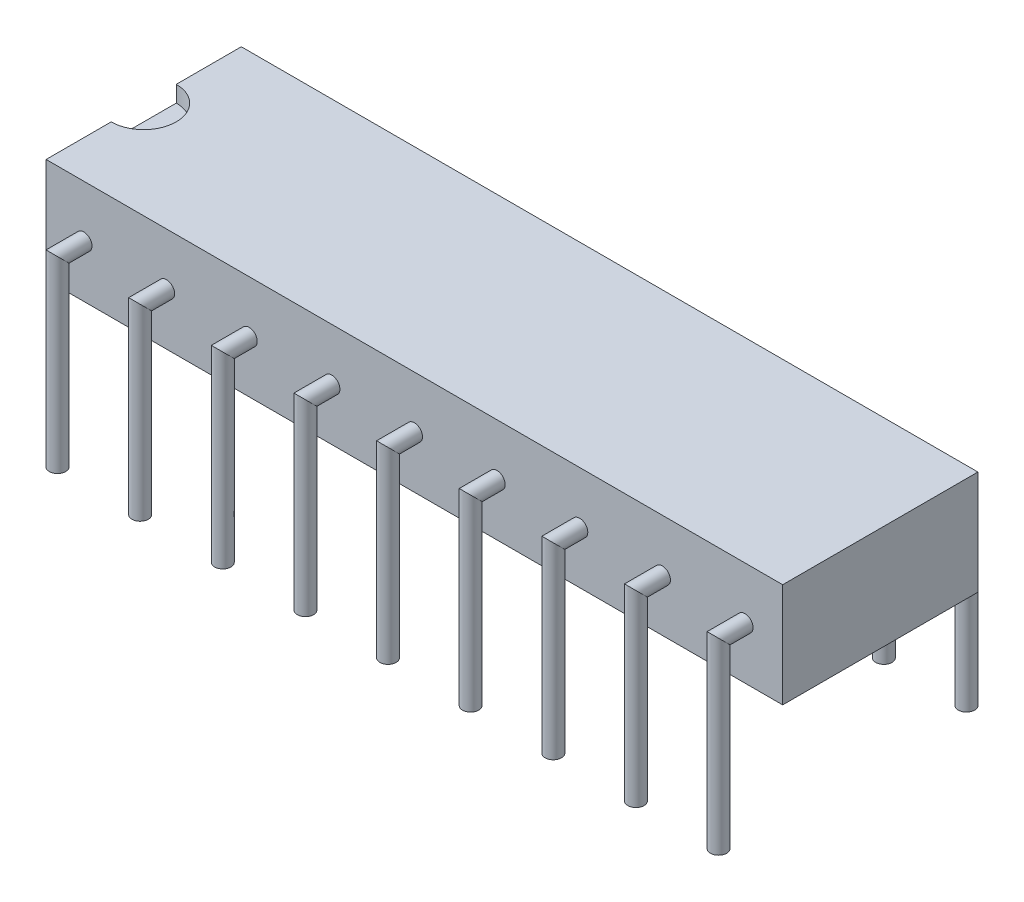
from build123d import *

# Parameters (mm, degrees)
ESQUISSE1_W                          = 6
ESQUISSE1_H                          = 3.2
EXTRUSION1_DEPTH                     = 22.64
ENL_V_MAT_EXTRU_1_DEPTH              = 0.5
ESQUISSE3_R                          = 0.25
R_P_TITION_LIN_AIRE1_COUNT           = 9
R_P_TITION_LIN_AIRE1_PITCH           = 2.54
R_P_TITION_LIN_AIRE1_COPY_1_SKETCH_R = 0.25
R_P_TITION_LIN_AIRE1_COPY_2_SKETCH_R = 0.25
R_P_TITION_LIN_AIRE1_COPY_3_SKETCH_R = 0.25
R_P_TITION_LIN_AIRE1_COPY_4_SKETCH_R = 0.25
R_P_TITION_LIN_AIRE1_COPY_5_SKETCH_R = 0.25
R_P_TITION_LIN_AIRE1_COPY_6_SKETCH_R = 0.25
R_P_TITION_LIN_AIRE1_COPY_7_SKETCH_R = 0.25
R_P_TITION_LIN_AIRE1_COPY_8_SKETCH_R = 0.25


with BuildPart() as part:
    # Esquisse1 → Extrusion1 (new body)
    with BuildSketch(Plane(origin=(0, 0, 0), x_dir=(0, 0, -1), z_dir=(1, 0, 0))):
        with Locations((0, 1.6)):
            Rectangle(ESQUISSE1_W, ESQUISSE1_H)
    extrude(amount=EXTRUSION1_DEPTH)

    # Esquisse2 → Enl_v. mat.-Extru.1 (cut)
    with BuildSketch(Plane(origin=(0, 3.2, 0), x_dir=(-1, 0, 0), z_dir=(0, 1, 0))):
        with BuildLine():
            Line((0, -1), (0, 1))
            ThreePointArc((0, 1), (-1, 0), (0, -1))
        make_face()
    extrude(amount=-ENL_V_MAT_EXTRU_1_DEPTH, mode=Mode.SUBTRACT)

    # Balayage1: sweep along a path in Esquisse5
    with BuildLine(Plane(origin=(1.16, 0, 0), x_dir=(0, 0, -1), z_dir=(1, 0, 0))) as balayage1_path:
        Line((-3, 1.6), (-3.81, 1.6))
        Line((-3.81, 1.6), (-3.81, -4))
    # Esquisse3 → Balayage1 (sweep)
    with BuildSketch(Plane.XY.offset(3)):
        with Locations((1.16, 1.6)):
            Circle(ESQUISSE3_R)
    balayage1 = sweep(path=balayage1_path.line, transition=Transition.RIGHT)

    # Sym_trie1: Balayage1 across plane
    add(balayage1.mirror(Plane.XY))

    # R_p_tition lin_aire1: Balayage1 ×9
    with Locations(*[(i * R_P_TITION_LIN_AIRE1_PITCH, 0, 0) for i in range(1, R_P_TITION_LIN_AIRE1_COUNT)]):
        add(balayage1)

    # R_p_tition lin_aire1 copy 1: sweep along a path in R_p_tition lin_aire1 copy 1 path
    with BuildLine(Plane(origin=(3.7, 0, 0), x_dir=(0, 0, 1), z_dir=(1, 0, 0))) as r_p_tition_lin_aire1_copy_1_path:
        Line((-3, -1.6), (-3.81, -1.6))
        Line((-3.81, -1.6), (-3.81, 4))
    # R_p_tition lin_aire1 copy 1 sketch → R_p_tition lin_aire1 copy 1 (sweep)
    with BuildSketch(Plane(origin=(2.54, 0, -3), x_dir=(1, 0, 0), z_dir=(0, 0, -1))):
        with Locations((1.16, -1.6)):
            Circle(R_P_TITION_LIN_AIRE1_COPY_1_SKETCH_R)
    sweep(path=r_p_tition_lin_aire1_copy_1_path.line, transition=Transition.RIGHT)

    # R_p_tition lin_aire1 copy 2: sweep along a path in R_p_tition lin_aire1 copy 2 path
    with BuildLine(Plane(origin=(6.24, 0, 0), x_dir=(0, 0, 1), z_dir=(1, 0, 0))) as r_p_tition_lin_aire1_copy_2_path:
        Line((-3, -1.6), (-3.81, -1.6))
        Line((-3.81, -1.6), (-3.81, 4))
    # R_p_tition lin_aire1 copy 2 sketch → R_p_tition lin_aire1 copy 2 (sweep)
    with BuildSketch(Plane(origin=(5.08, 0, -3), x_dir=(1, 0, 0), z_dir=(0, 0, -1))):
        with Locations((1.16, -1.6)):
            Circle(R_P_TITION_LIN_AIRE1_COPY_2_SKETCH_R)
    sweep(path=r_p_tition_lin_aire1_copy_2_path.line, transition=Transition.RIGHT)

    # R_p_tition lin_aire1 copy 3: sweep along a path in R_p_tition lin_aire1 copy 3 path
    with BuildLine(Plane(origin=(8.78, 0, 0), x_dir=(0, 0, 1), z_dir=(1, 0, 0))) as r_p_tition_lin_aire1_copy_3_path:
        Line((-3, -1.6), (-3.81, -1.6))
        Line((-3.81, -1.6), (-3.81, 4))
    # R_p_tition lin_aire1 copy 3 sketch → R_p_tition lin_aire1 copy 3 (sweep)
    with BuildSketch(Plane(origin=(7.62, 0, -3), x_dir=(1, 0, 0), z_dir=(0, 0, -1))):
        with Locations((1.16, -1.6)):
            Circle(R_P_TITION_LIN_AIRE1_COPY_3_SKETCH_R)
    sweep(path=r_p_tition_lin_aire1_copy_3_path.line, transition=Transition.RIGHT)

    # R_p_tition lin_aire1 copy 4: sweep along a path in R_p_tition lin_aire1 copy 4 path
    with BuildLine(Plane(origin=(11.32, 0, 0), x_dir=(0, 0, 1), z_dir=(1, 0, 0))) as r_p_tition_lin_aire1_copy_4_path:
        Line((-3, -1.6), (-3.81, -1.6))
        Line((-3.81, -1.6), (-3.81, 4))
    # R_p_tition lin_aire1 copy 4 sketch → R_p_tition lin_aire1 copy 4 (sweep)
    with BuildSketch(Plane(origin=(10.16, 0, -3), x_dir=(1, 0, 0), z_dir=(0, 0, -1))):
        with Locations((1.16, -1.6)):
            Circle(R_P_TITION_LIN_AIRE1_COPY_4_SKETCH_R)
    sweep(path=r_p_tition_lin_aire1_copy_4_path.line, transition=Transition.RIGHT)

    # R_p_tition lin_aire1 copy 5: sweep along a path in R_p_tition lin_aire1 copy 5 path
    with BuildLine(Plane(origin=(13.86, 0, 0), x_dir=(0, 0, 1), z_dir=(1, 0, 0))) as r_p_tition_lin_aire1_copy_5_path:
        Line((-3, -1.6), (-3.81, -1.6))
        Line((-3.81, -1.6), (-3.81, 4))
    # R_p_tition lin_aire1 copy 5 sketch → R_p_tition lin_aire1 copy 5 (sweep)
    with BuildSketch(Plane(origin=(12.7, 0, -3), x_dir=(1, 0, 0), z_dir=(0, 0, -1))):
        with Locations((1.16, -1.6)):
            Circle(R_P_TITION_LIN_AIRE1_COPY_5_SKETCH_R)
    sweep(path=r_p_tition_lin_aire1_copy_5_path.line, transition=Transition.RIGHT)

    # R_p_tition lin_aire1 copy 6: sweep along a path in R_p_tition lin_aire1 copy 6 path
    with BuildLine(Plane(origin=(16.4, 0, 0), x_dir=(0, 0, 1), z_dir=(1, 0, 0))) as r_p_tition_lin_aire1_copy_6_path:
        Line((-3, -1.6), (-3.81, -1.6))
        Line((-3.81, -1.6), (-3.81, 4))
    # R_p_tition lin_aire1 copy 6 sketch → R_p_tition lin_aire1 copy 6 (sweep)
    with BuildSketch(Plane(origin=(15.24, 0, -3), x_dir=(1, 0, 0), z_dir=(0, 0, -1))):
        with Locations((1.16, -1.6)):
            Circle(R_P_TITION_LIN_AIRE1_COPY_6_SKETCH_R)
    sweep(path=r_p_tition_lin_aire1_copy_6_path.line, transition=Transition.RIGHT)

    # R_p_tition lin_aire1 copy 7: sweep along a path in R_p_tition lin_aire1 copy 7 path
    with BuildLine(Plane(origin=(18.94, 0, 0), x_dir=(0, 0, 1), z_dir=(1, 0, 0))) as r_p_tition_lin_aire1_copy_7_path:
        Line((-3, -1.6), (-3.81, -1.6))
        Line((-3.81, -1.6), (-3.81, 4))
    # R_p_tition lin_aire1 copy 7 sketch → R_p_tition lin_aire1 copy 7 (sweep)
    with BuildSketch(Plane(origin=(17.78, 0, -3), x_dir=(1, 0, 0), z_dir=(0, 0, -1))):
        with Locations((1.16, -1.6)):
            Circle(R_P_TITION_LIN_AIRE1_COPY_7_SKETCH_R)
    sweep(path=r_p_tition_lin_aire1_copy_7_path.line, transition=Transition.RIGHT)

    # R_p_tition lin_aire1 copy 8: sweep along a path in R_p_tition lin_aire1 copy 8 path
    with BuildLine(Plane(origin=(21.48, 0, 0), x_dir=(0, 0, 1), z_dir=(1, 0, 0))) as r_p_tition_lin_aire1_copy_8_path:
        Line((-3, -1.6), (-3.81, -1.6))
        Line((-3.81, -1.6), (-3.81, 4))
    # R_p_tition lin_aire1 copy 8 sketch → R_p_tition lin_aire1 copy 8 (sweep)
    with BuildSketch(Plane(origin=(20.32, 0, -3), x_dir=(1, 0, 0), z_dir=(0, 0, -1))):
        with Locations((1.16, -1.6)):
            Circle(R_P_TITION_LIN_AIRE1_COPY_8_SKETCH_R)
    sweep(path=r_p_tition_lin_aire1_copy_8_path.line, transition=Transition.RIGHT)


solid = part.part
